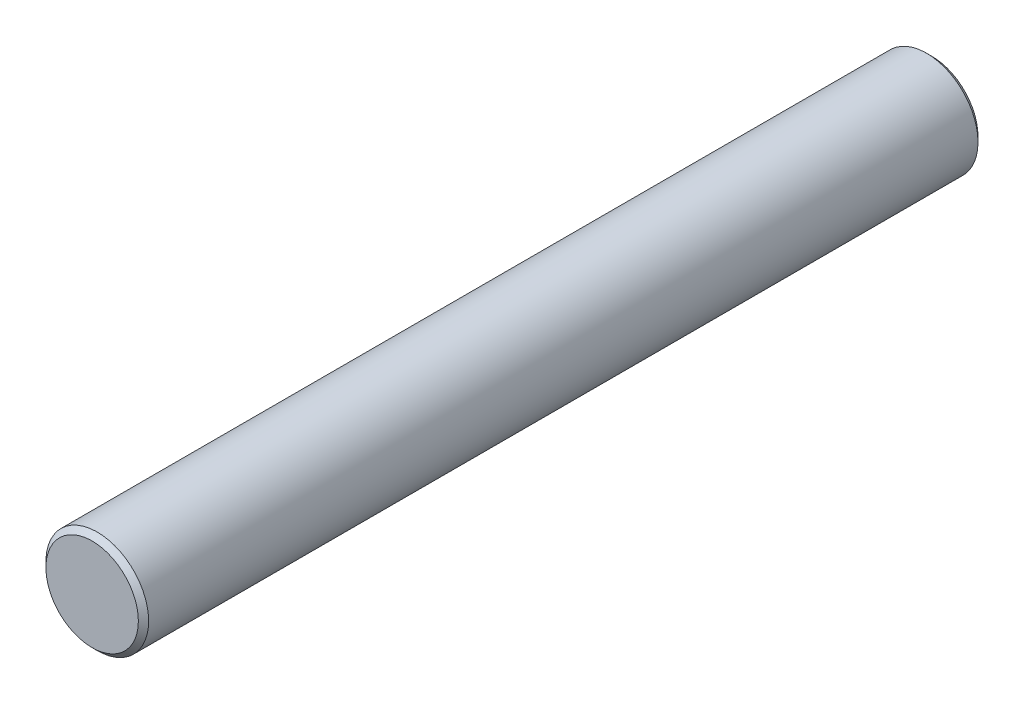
from build123d import *


with BuildPart() as part:
    # Esquisse1 → R_volution1 (revolve)
    with BuildSketch(Plane(origin=(0, 0, 0), x_dir=(1, 0, 0), z_dir=(0, 1, 0))):
        Polygon((7, 88.5), (0, 84.293975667), (0, -188.706024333), (18, -188.706024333), (20, -186.706024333), (20, 136.293975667), (18, 138.293975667), (7, 138.293975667), align=None)
    revolve(axis=Axis((0, 0, -138.5), (0, 0, 1)))


solid = part.part
